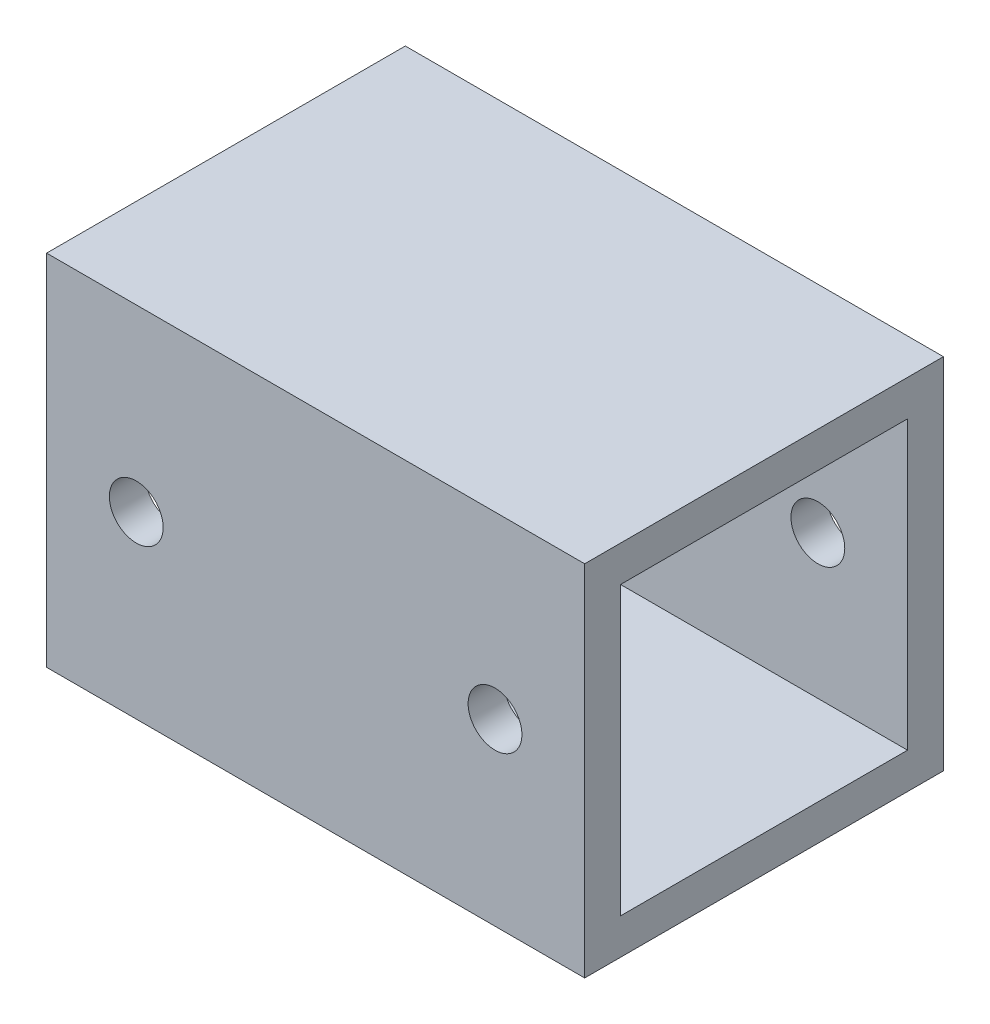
from build123d import *

# Parameters (mm, degrees)
SKETCH_1_W          = 20
SKETCH_1_H          = 20
SKETCH_1_W_2        = 16
SKETCH_1_H_2        = 16
EXTRUDE_1_DEPTH     = 30
SKETCH_2_R          = 1.5
CUT_EXTRUDE_2_DEPTH = 38.416573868
SKETCH_3_R          = 1.5
CUT_EXTRUDE_3_DEPTH = 38.416573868


with BuildPart() as part:
    # Sketch 1 → Extrude 1 (new body)
    with BuildSketch(Plane(origin=(0, 0, 0), x_dir=(0, 0, -1), z_dir=(1, 0, 0))):
        Rectangle(SKETCH_1_W, SKETCH_1_H)
        Rectangle(SKETCH_1_W_2, SKETCH_1_H_2, mode=Mode.SUBTRACT)
    extrude(amount=EXTRUDE_1_DEPTH)

    # Sketch 2 → Cut-Extrude 2 (cut, through all)
    with BuildSketch(Plane.XY.offset(10)):
        with Locations((5, 0)):
            Circle(SKETCH_2_R)
    extrude(amount=-CUT_EXTRUDE_2_DEPTH, mode=Mode.SUBTRACT)

    # Sketch 3 → Cut-Extrude 3 (cut, through all)
    with BuildSketch(Plane.XY.offset(10)):
        with Locations((25, 0)):
            Circle(SKETCH_3_R)
    extrude(amount=-CUT_EXTRUDE_3_DEPTH, mode=Mode.SUBTRACT)


solid = part.part
